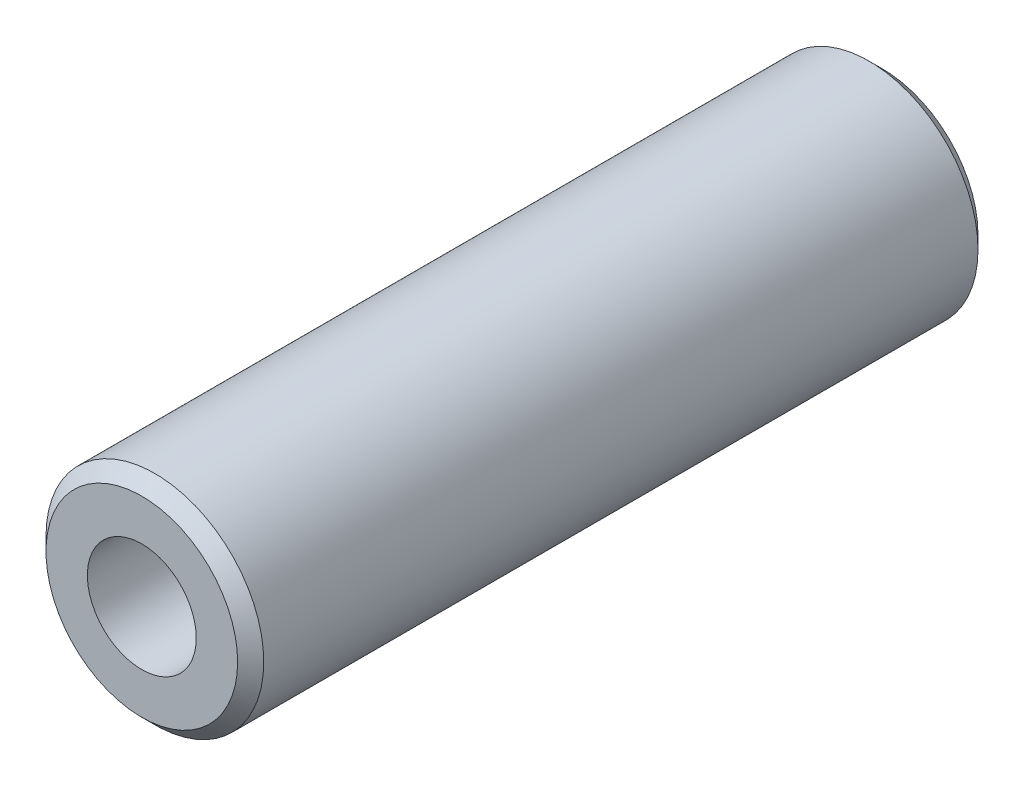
ISO-10303-21;
HEADER;
FILE_DESCRIPTION(('STEP AP214'),'2;1');
FILE_NAME('part.step','',(''),(''),'','','');
FILE_SCHEMA(('AUTOMOTIVE_DESIGN { 1 0 10303 214 1 1 1 1 }'));
ENDSEC;
DATA;
#1=APPLICATION_CONTEXT('core data for automotive mechanical design processes');
#2=APPLICATION_PROTOCOL_DEFINITION('international standard','automotive_design',2000,#1);
#3=PRODUCT_CONTEXT('',#1,'mechanical');
#4=PRODUCT('Part','Part','',(#3));
#5=PRODUCT_RELATED_PRODUCT_CATEGORY('part','',(#4));
#6=PRODUCT_DEFINITION_FORMATION('','',#4);
#7=PRODUCT_DEFINITION_CONTEXT('part definition',#1,'design');
#8=PRODUCT_DEFINITION('design','',#6,#7);
#9=PRODUCT_DEFINITION_SHAPE('','',#8);
#10=(LENGTH_UNIT() NAMED_UNIT(*) SI_UNIT(.MILLI.,.METRE.));
#11=(NAMED_UNIT(*) PLANE_ANGLE_UNIT() SI_UNIT($,.RADIAN.));
#12=(NAMED_UNIT(*) SI_UNIT($,.STERADIAN.) SOLID_ANGLE_UNIT());
#13=UNCERTAINTY_MEASURE_WITH_UNIT(LENGTH_MEASURE(1.E-05),#10,'distance_accuracy_value','');
#14=(GEOMETRIC_REPRESENTATION_CONTEXT(3) GLOBAL_UNCERTAINTY_ASSIGNED_CONTEXT((#13)) GLOBAL_UNIT_ASSIGNED_CONTEXT((#10,
#11,#12)) REPRESENTATION_CONTEXT('',''));
#15=CARTESIAN_POINT('',(0.,0.,0.));
#16=DIRECTION('',(0.,0.,1.));
#17=DIRECTION('',(1.,0.,0.));
#18=AXIS2_PLACEMENT_3D('',#15,#16,#17);
#19=CARTESIAN_POINT('',(0.,0.,43.18));
#20=DIRECTION('',(0.,0.,1.));
#21=DIRECTION('',(1.,0.,0.));
#22=AXIS2_PLACEMENT_3D('',#19,#20,#21);
#23=PLANE('',#22);
#24=CARTESIAN_POINT('',(0.,0.,43.18));
#25=DIRECTION('',(0.,0.,1.));
#26=DIRECTION('',(1.,0.,0.));
#27=AXIS2_PLACEMENT_3D('',#24,#25,#26);
#28=CIRCLE('',#27,5.588);
#29=CARTESIAN_POINT('',(5.588,0.,43.18));
#30=VERTEX_POINT('',#29);
#31=EDGE_CURVE('E10',#30,#30,#28,.T.);
#32=ORIENTED_EDGE('',*,*,#31,.T.);
#33=EDGE_LOOP('',(#32));
#34=FACE_BOUND('',#33,.T.);
#35=CARTESIAN_POINT('',(0.,0.,43.18));
#36=DIRECTION('',(0.,0.,1.));
#37=DIRECTION('',(1.,0.,0.));
#38=AXIS2_PLACEMENT_3D('',#35,#36,#37);
#39=CIRCLE('',#38,3.175);
#40=CARTESIAN_POINT('',(3.175,0.,43.18));
#41=VERTEX_POINT('',#40);
#42=EDGE_CURVE('E51',#41,#41,#39,.T.);
#43=ORIENTED_EDGE('',*,*,#42,.F.);
#44=EDGE_LOOP('',(#43));
#45=FACE_BOUND('',#44,.T.);
#46=ADVANCED_FACE('F31',(#34,#45),#23,.T.);
#47=CARTESIAN_POINT('',(0.,0.,0.));
#48=DIRECTION('',(0.,0.,1.));
#49=DIRECTION('',(1.,0.,0.));
#50=AXIS2_PLACEMENT_3D('',#47,#48,#49);
#51=PLANE('',#50);
#52=CARTESIAN_POINT('',(0.,0.,0.));
#53=DIRECTION('',(0.,0.,1.));
#54=DIRECTION('',(1.,0.,0.));
#55=AXIS2_PLACEMENT_3D('',#52,#53,#54);
#56=CIRCLE('',#55,5.588);
#57=CARTESIAN_POINT('',(5.588,0.,0.));
#58=VERTEX_POINT('',#57);
#59=EDGE_CURVE('E38',#58,#58,#56,.F.);
#60=ORIENTED_EDGE('',*,*,#59,.T.);
#61=EDGE_LOOP('',(#60));
#62=FACE_BOUND('',#61,.T.);
#63=CARTESIAN_POINT('',(0.,0.,0.));
#64=DIRECTION('',(0.,0.,1.));
#65=DIRECTION('',(1.,0.,0.));
#66=AXIS2_PLACEMENT_3D('',#63,#64,#65);
#67=CIRCLE('',#66,3.175);
#68=CARTESIAN_POINT('',(3.175,0.,0.));
#69=VERTEX_POINT('',#68);
#70=EDGE_CURVE('E52',#69,#69,#67,.T.);
#71=ORIENTED_EDGE('',*,*,#70,.T.);
#72=EDGE_LOOP('',(#71));
#73=FACE_BOUND('',#72,.T.);
#74=ADVANCED_FACE('F62',(#62,#73),#51,.F.);
#75=CARTESIAN_POINT('',(0.,0.,43.18));
#76=DIRECTION('',(0.,0.,-1.));
#77=DIRECTION('',(-1.,0.,0.));
#78=AXIS2_PLACEMENT_3D('',#75,#76,#77);
#79=CYLINDRICAL_SURFACE('',#78,6.35);
#80=CARTESIAN_POINT('',(0.,0.,0.761999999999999));
#81=DIRECTION('',(0.,0.,1.));
#82=DIRECTION('',(1.,0.,0.));
#83=AXIS2_PLACEMENT_3D('',#80,#81,#82);
#84=CIRCLE('',#83,6.35);
#85=CARTESIAN_POINT('',(6.35,0.,0.761999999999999));
#86=VERTEX_POINT('',#85);
#87=EDGE_CURVE('E42',#86,#86,#84,.T.);
#88=ORIENTED_EDGE('',*,*,#87,.T.);
#89=EDGE_LOOP('',(#88));
#90=FACE_BOUND('',#89,.T.);
#91=CARTESIAN_POINT('',(0.,0.,42.418));
#92=DIRECTION('',(0.,0.,1.));
#93=DIRECTION('',(1.,0.,0.));
#94=AXIS2_PLACEMENT_3D('',#91,#92,#93);
#95=CIRCLE('',#94,6.35);
#96=CARTESIAN_POINT('',(6.35,0.,42.418));
#97=VERTEX_POINT('',#96);
#98=EDGE_CURVE('E46',#97,#97,#95,.F.);
#99=ORIENTED_EDGE('',*,*,#98,.T.);
#100=EDGE_LOOP('',(#99));
#101=FACE_BOUND('',#100,.T.);
#102=ADVANCED_FACE('F67',(#90,#101),#79,.T.);
#103=CARTESIAN_POINT('',(0.,0.,43.18));
#104=DIRECTION('',(0.,0.,-1.));
#105=DIRECTION('',(-1.,0.,0.));
#106=AXIS2_PLACEMENT_3D('',#103,#104,#105);
#107=CYLINDRICAL_SURFACE('',#106,3.175);
#108=ORIENTED_EDGE('',*,*,#42,.T.);
#109=EDGE_LOOP('',(#108));
#110=FACE_BOUND('',#109,.T.);
#111=ORIENTED_EDGE('',*,*,#70,.F.);
#112=EDGE_LOOP('',(#111));
#113=FACE_BOUND('',#112,.T.);
#114=ADVANCED_FACE('F58',(#110,#113),#107,.F.);
#115=CARTESIAN_POINT('',(0.,0.,0.761999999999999));
#116=DIRECTION('',(0.,0.,1.));
#117=DIRECTION('',(1.,0.,0.));
#118=AXIS2_PLACEMENT_3D('',#115,#116,#117);
#119=CONICAL_SURFACE('',#118,6.35,0.785398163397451);
#120=ORIENTED_EDGE('',*,*,#59,.F.);
#121=EDGE_LOOP('',(#120));
#122=FACE_BOUND('',#121,.T.);
#123=ORIENTED_EDGE('',*,*,#87,.F.);
#124=EDGE_LOOP('',(#123));
#125=FACE_BOUND('',#124,.T.);
#126=ADVANCED_FACE('F73',(#122,#125),#119,.T.);
#127=CARTESIAN_POINT('',(0.,0.,43.18));
#128=DIRECTION('',(0.,0.,-1.));
#129=DIRECTION('',(-1.,0.,0.));
#130=AXIS2_PLACEMENT_3D('',#127,#128,#129);
#131=CONICAL_SURFACE('',#130,5.588,0.785398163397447);
#132=ORIENTED_EDGE('',*,*,#98,.F.);
#133=EDGE_LOOP('',(#132));
#134=FACE_BOUND('',#133,.T.);
#135=ORIENTED_EDGE('',*,*,#31,.F.);
#136=EDGE_LOOP('',(#135));
#137=FACE_BOUND('',#136,.T.);
#138=ADVANCED_FACE('F33',(#134,#137),#131,.T.);
#139=CLOSED_SHELL('',(#46,#74,#102,#114,#126,#138));
#140=MANIFOLD_SOLID_BREP('B2',#139);
#141=ADVANCED_BREP_SHAPE_REPRESENTATION('',(#18,#140),#14);
#142=SHAPE_DEFINITION_REPRESENTATION(#9,#141);
ENDSEC;
END-ISO-10303-21;
